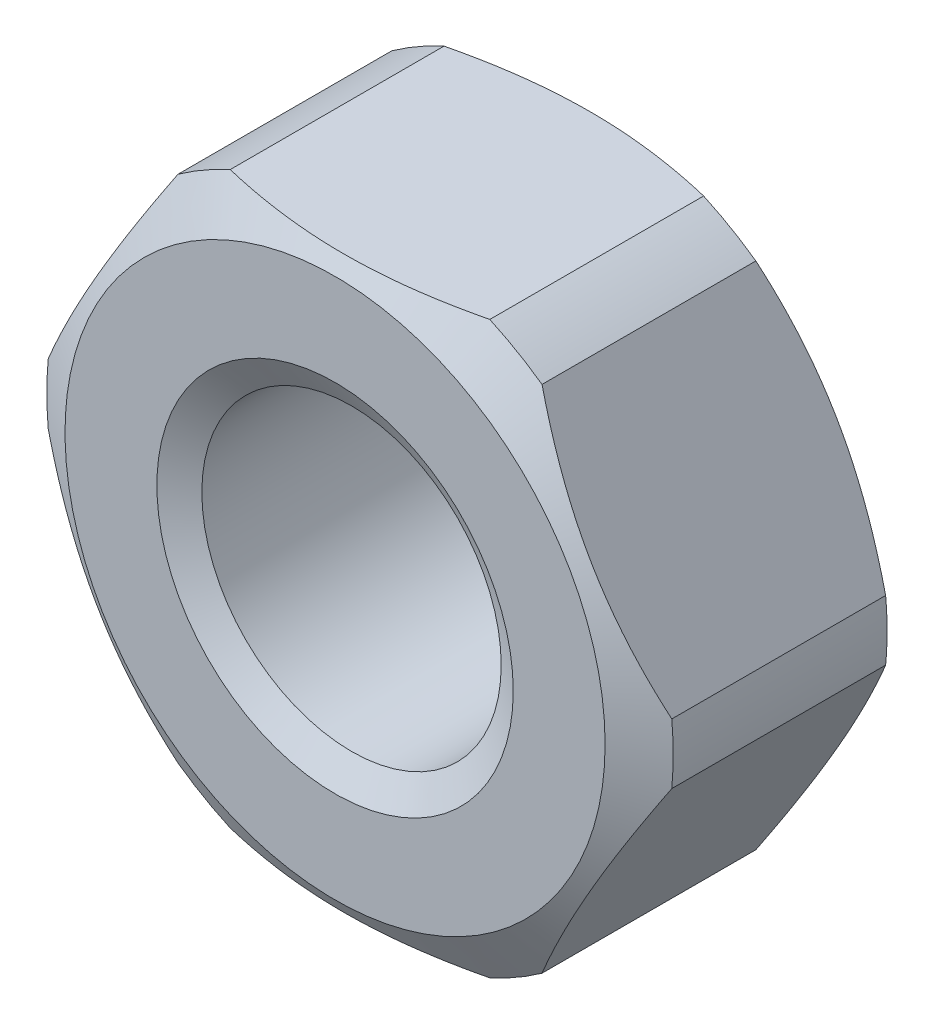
from build123d import *

# Parameters (mm, degrees)
SKETCH2_OUTSIDE_W  = 13.384
SKETCH2_OUTSIDE_H  = 13.384
CUT_EXTRUDE1_DEPTH = 8.233398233


with BuildPart() as part:
    # Sketch1 → Revolve1 (revolve)
    with BuildSketch(Plane(origin=(0, 0, 0), x_dir=(0, 0, -1), z_dir=(1, 0, 0)), mode=Mode.PRIVATE) as revolve1_sk:
        Polygon((3.469059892, 2.1), (0.230940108, 2.1), (0, 2.5), (0, 3.788782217), (0.35, 4.395), (3.35, 4.395), (3.7, 3.788782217), (3.7, 2.5), (0.011547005, 2.5), (0.017320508, 2.49), (3.694226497, 2.49), align=None)
    revolve(revolve1_sk.sketch.rotate(Axis((0, 0, 0), (0, 0, -1)), 90), axis=Axis((0, 0, 0), (0, 0, -1)))

    # Sketch2 outside → Cut-Extrude1 (cut, through all)
    with BuildSketch(Plane.XY):
        Rectangle(SKETCH2_OUTSIDE_W, SKETCH2_OUTSIDE_H)
        Polygon((2.309401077, -4), (4.618802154, 0), (2.309401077, 4), (-2.309401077, 4), (-4.618802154, 0), (-2.309401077, -4), align=None, mode=Mode.SUBTRACT)
    extrude(amount=-CUT_EXTRUDE1_DEPTH, mode=Mode.SUBTRACT)


solid = part.part
